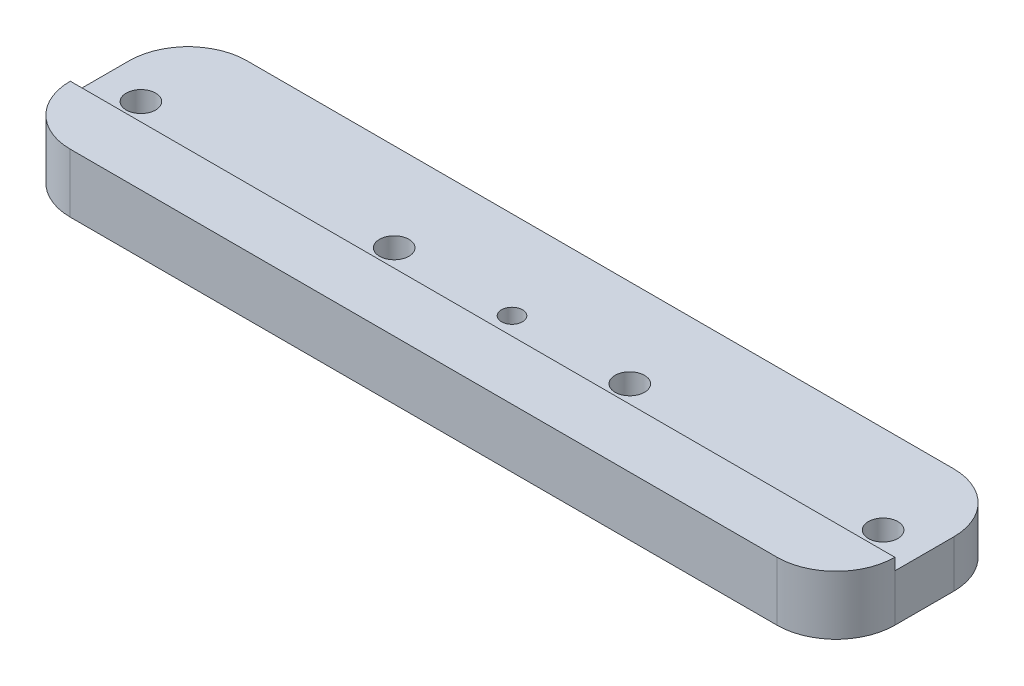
ISO-10303-21;
HEADER;
FILE_DESCRIPTION(('STEP AP214'),'2;1');
FILE_NAME('part.step','',(''),(''),'','','');
FILE_SCHEMA(('AUTOMOTIVE_DESIGN { 1 0 10303 214 1 1 1 1 }'));
ENDSEC;
DATA;
#1=APPLICATION_CONTEXT('core data for automotive mechanical design processes');
#2=APPLICATION_PROTOCOL_DEFINITION('international standard','automotive_design',2000,#1);
#3=PRODUCT_CONTEXT('',#1,'mechanical');
#4=PRODUCT('Part','Part','',(#3));
#5=PRODUCT_RELATED_PRODUCT_CATEGORY('part','',(#4));
#6=PRODUCT_DEFINITION_FORMATION('','',#4);
#7=PRODUCT_DEFINITION_CONTEXT('part definition',#1,'design');
#8=PRODUCT_DEFINITION('design','',#6,#7);
#9=PRODUCT_DEFINITION_SHAPE('','',#8);
#10=(LENGTH_UNIT() NAMED_UNIT(*) SI_UNIT(.MILLI.,.METRE.));
#11=(NAMED_UNIT(*) PLANE_ANGLE_UNIT() SI_UNIT($,.RADIAN.));
#12=(NAMED_UNIT(*) SI_UNIT($,.STERADIAN.) SOLID_ANGLE_UNIT());
#13=UNCERTAINTY_MEASURE_WITH_UNIT(LENGTH_MEASURE(1.E-05),#10,'distance_accuracy_value','');
#14=(GEOMETRIC_REPRESENTATION_CONTEXT(3) GLOBAL_UNCERTAINTY_ASSIGNED_CONTEXT((#13)) GLOBAL_UNIT_ASSIGNED_CONTEXT((#10,
#11,#12)) REPRESENTATION_CONTEXT('',''));
#15=CARTESIAN_POINT('',(0.,0.,0.));
#16=DIRECTION('',(0.,0.,1.));
#17=DIRECTION('',(1.,0.,0.));
#18=AXIS2_PLACEMENT_3D('',#15,#16,#17);
#19=CARTESIAN_POINT('',(44.45,6.35,9.525));
#20=DIRECTION('',(-1.,0.,0.));
#21=DIRECTION('',(0.,0.,1.));
#22=AXIS2_PLACEMENT_3D('',#19,#20,#21);
#23=PLANE('',#22);
#24=DIRECTION('',(0.,0.,-1.));
#25=VECTOR('',#24,1.);
#26=CARTESIAN_POINT('',(44.45,5.08,3.175));
#27=LINE('',#26,#25);
#28=CARTESIAN_POINT('',(44.45,5.08,3.175));
#29=VERTEX_POINT('',#28);
#30=CARTESIAN_POINT('',(44.45,5.08,-3.175));
#31=VERTEX_POINT('',#30);
#32=EDGE_CURVE('E125',#29,#31,#27,.T.);
#33=ORIENTED_EDGE('',*,*,#32,.F.);
#34=DIRECTION('',(0.,-1.,0.));
#35=VECTOR('',#34,1.);
#36=CARTESIAN_POINT('',(44.45,6.35,3.175));
#37=LINE('',#36,#35);
#38=CARTESIAN_POINT('',(44.45,0.,3.175));
#39=VERTEX_POINT('',#38);
#40=EDGE_CURVE('E120',#29,#39,#37,.T.);
#41=ORIENTED_EDGE('',*,*,#40,.T.);
#42=DIRECTION('',(0.,0.,-1.));
#43=VECTOR('',#42,1.);
#44=CARTESIAN_POINT('',(44.45,0.,9.525));
#45=LINE('',#44,#43);
#46=CARTESIAN_POINT('',(44.45,0.,-3.175));
#47=VERTEX_POINT('',#46);
#48=EDGE_CURVE('E189',#39,#47,#45,.T.);
#49=ORIENTED_EDGE('',*,*,#48,.T.);
#50=DIRECTION('',(0.,-1.,0.));
#51=VECTOR('',#50,1.);
#52=CARTESIAN_POINT('',(44.45,6.35,-3.175));
#53=LINE('',#52,#51);
#54=EDGE_CURVE('E119',#47,#31,#53,.F.);
#55=ORIENTED_EDGE('',*,*,#54,.T.);
#56=EDGE_LOOP('',(#33,#41,#49,#55));
#57=FACE_BOUND('',#56,.T.);
#58=ADVANCED_FACE('F37',(#57),#23,.F.);
#59=CARTESIAN_POINT('',(-44.45,6.35,-9.525));
#60=DIRECTION('',(0.,0.,1.));
#61=DIRECTION('',(1.,0.,0.));
#62=AXIS2_PLACEMENT_3D('',#59,#60,#61);
#63=PLANE('',#62);
#64=DIRECTION('',(-1.,0.,0.));
#65=VECTOR('',#64,1.);
#66=CARTESIAN_POINT('',(38.1,5.08,-9.525));
#67=LINE('',#66,#65);
#68=CARTESIAN_POINT('',(38.1,5.08,-9.525));
#69=VERTEX_POINT('',#68);
#70=CARTESIAN_POINT('',(-38.1,5.08,-9.525));
#71=VERTEX_POINT('',#70);
#72=EDGE_CURVE('E169',#69,#71,#67,.T.);
#73=ORIENTED_EDGE('',*,*,#72,.F.);
#74=DIRECTION('',(0.,-1.,0.));
#75=VECTOR('',#74,1.);
#76=CARTESIAN_POINT('',(38.1,6.35,-9.525));
#77=LINE('',#76,#75);
#78=CARTESIAN_POINT('',(38.1,0.,-9.525));
#79=VERTEX_POINT('',#78);
#80=EDGE_CURVE('E206',#69,#79,#77,.T.);
#81=ORIENTED_EDGE('',*,*,#80,.T.);
#82=DIRECTION('',(-1.,0.,0.));
#83=VECTOR('',#82,1.);
#84=CARTESIAN_POINT('',(-44.45,0.,-9.525));
#85=LINE('',#84,#83);
#86=CARTESIAN_POINT('',(-38.1,0.,-9.525));
#87=VERTEX_POINT('',#86);
#88=EDGE_CURVE('E195',#79,#87,#85,.T.);
#89=ORIENTED_EDGE('',*,*,#88,.T.);
#90=DIRECTION('',(0.,-1.,0.));
#91=VECTOR('',#90,1.);
#92=CARTESIAN_POINT('',(-38.1,6.35,-9.525));
#93=LINE('',#92,#91);
#94=EDGE_CURVE('E192',#87,#71,#93,.F.);
#95=ORIENTED_EDGE('',*,*,#94,.T.);
#96=EDGE_LOOP('',(#73,#81,#89,#95));
#97=FACE_BOUND('',#96,.T.);
#98=ADVANCED_FACE('F236',(#97),#63,.F.);
#99=CARTESIAN_POINT('',(-44.45,6.35,9.525));
#100=DIRECTION('',(1.,0.,0.));
#101=DIRECTION('',(0.,0.,-1.));
#102=AXIS2_PLACEMENT_3D('',#99,#100,#101);
#103=PLANE('',#102);
#104=DIRECTION('',(0.,0.,1.));
#105=VECTOR('',#104,1.);
#106=CARTESIAN_POINT('',(-44.45,5.08,-3.175));
#107=LINE('',#106,#105);
#108=CARTESIAN_POINT('',(-44.45,5.08,-3.175));
#109=VERTEX_POINT('',#108);
#110=CARTESIAN_POINT('',(-44.45,5.08,3.175));
#111=VERTEX_POINT('',#110);
#112=EDGE_CURVE('E52',#109,#111,#107,.T.);
#113=ORIENTED_EDGE('',*,*,#112,.F.);
#114=DIRECTION('',(0.,-1.,0.));
#115=VECTOR('',#114,1.);
#116=CARTESIAN_POINT('',(-44.45,6.35,-3.175));
#117=LINE('',#116,#115);
#118=CARTESIAN_POINT('',(-44.45,0.,-3.175));
#119=VERTEX_POINT('',#118);
#120=EDGE_CURVE('E11',#109,#119,#117,.T.);
#121=ORIENTED_EDGE('',*,*,#120,.T.);
#122=DIRECTION('',(0.,0.,1.));
#123=VECTOR('',#122,1.);
#124=CARTESIAN_POINT('',(-44.45,0.,9.525));
#125=LINE('',#124,#123);
#126=CARTESIAN_POINT('',(-44.45,0.,3.175));
#127=VERTEX_POINT('',#126);
#128=EDGE_CURVE('E157',#119,#127,#125,.T.);
#129=ORIENTED_EDGE('',*,*,#128,.T.);
#130=DIRECTION('',(0.,-1.,0.));
#131=VECTOR('',#130,1.);
#132=CARTESIAN_POINT('',(-44.45,6.35,3.175));
#133=LINE('',#132,#131);
#134=EDGE_CURVE('E45',#127,#111,#133,.F.);
#135=ORIENTED_EDGE('',*,*,#134,.T.);
#136=EDGE_LOOP('',(#113,#121,#129,#135));
#137=FACE_BOUND('',#136,.T.);
#138=ADVANCED_FACE('F154',(#137),#103,.F.);
#139=CARTESIAN_POINT('',(12.7,6.35,0.));
#140=DIRECTION('',(0.,1.,0.));
#141=DIRECTION('',(0.,0.,1.));
#142=AXIS2_PLACEMENT_3D('',#139,#140,#141);
#143=CYLINDRICAL_SURFACE('',#142,1.5875);
#144=CARTESIAN_POINT('',(12.7,0.,0.));
#145=DIRECTION('',(0.,-1.,0.));
#146=DIRECTION('',(0.,0.,-1.));
#147=AXIS2_PLACEMENT_3D('',#144,#145,#146);
#148=CIRCLE('',#147,1.5875);
#149=CARTESIAN_POINT('',(12.7,0.,-1.5875));
#150=VERTEX_POINT('',#149);
#151=EDGE_CURVE('E186',#150,#150,#148,.T.);
#152=ORIENTED_EDGE('',*,*,#151,.T.);
#153=EDGE_LOOP('',(#152));
#154=FACE_BOUND('',#153,.T.);
#155=CARTESIAN_POINT('',(12.7,5.08,0.));
#156=DIRECTION('',(0.,1.,0.));
#157=DIRECTION('',(0.,0.,1.));
#158=AXIS2_PLACEMENT_3D('',#155,#156,#157);
#159=CIRCLE('',#158,1.5875);
#160=CARTESIAN_POINT('',(12.7,5.08,1.5875));
#161=VERTEX_POINT('',#160);
#162=EDGE_CURVE('E178',#161,#161,#159,.F.);
#163=ORIENTED_EDGE('',*,*,#162,.F.);
#164=EDGE_LOOP('',(#163));
#165=FACE_BOUND('',#164,.T.);
#166=ADVANCED_FACE('F260',(#154,#165),#143,.F.);
#167=CARTESIAN_POINT('',(-12.7,6.35,0.));
#168=DIRECTION('',(0.,1.,0.));
#169=DIRECTION('',(0.,0.,1.));
#170=AXIS2_PLACEMENT_3D('',#167,#168,#169);
#171=CYLINDRICAL_SURFACE('',#170,1.5875);
#172=CARTESIAN_POINT('',(-12.7,0.,0.));
#173=DIRECTION('',(0.,-1.,0.));
#174=DIRECTION('',(0.,0.,-1.));
#175=AXIS2_PLACEMENT_3D('',#172,#173,#174);
#176=CIRCLE('',#175,1.5875);
#177=CARTESIAN_POINT('',(-12.7,0.,-1.5875));
#178=VERTEX_POINT('',#177);
#179=EDGE_CURVE('E185',#178,#178,#176,.T.);
#180=ORIENTED_EDGE('',*,*,#179,.T.);
#181=EDGE_LOOP('',(#180));
#182=FACE_BOUND('',#181,.T.);
#183=CARTESIAN_POINT('',(-12.7,5.08,0.));
#184=DIRECTION('',(0.,1.,0.));
#185=DIRECTION('',(0.,0.,1.));
#186=AXIS2_PLACEMENT_3D('',#183,#184,#185);
#187=CIRCLE('',#186,1.5875);
#188=CARTESIAN_POINT('',(-12.7,5.08,1.5875));
#189=VERTEX_POINT('',#188);
#190=EDGE_CURVE('E175',#189,#189,#187,.F.);
#191=ORIENTED_EDGE('',*,*,#190,.F.);
#192=EDGE_LOOP('',(#191));
#193=FACE_BOUND('',#192,.T.);
#194=ADVANCED_FACE('F270',(#182,#193),#171,.F.);
#195=CARTESIAN_POINT('',(40.005,6.35,0.));
#196=DIRECTION('',(0.,1.,0.));
#197=DIRECTION('',(0.,0.,1.));
#198=AXIS2_PLACEMENT_3D('',#195,#196,#197);
#199=CYLINDRICAL_SURFACE('',#198,1.5875);
#200=CARTESIAN_POINT('',(40.005,0.,0.));
#201=DIRECTION('',(0.,-1.,0.));
#202=DIRECTION('',(0.,0.,-1.));
#203=AXIS2_PLACEMENT_3D('',#200,#201,#202);
#204=CIRCLE('',#203,1.5875);
#205=CARTESIAN_POINT('',(40.005,0.,-1.5875));
#206=VERTEX_POINT('',#205);
#207=EDGE_CURVE('E182',#206,#206,#204,.T.);
#208=ORIENTED_EDGE('',*,*,#207,.T.);
#209=EDGE_LOOP('',(#208));
#210=FACE_BOUND('',#209,.T.);
#211=CARTESIAN_POINT('',(40.005,5.08,0.));
#212=DIRECTION('',(0.,1.,0.));
#213=DIRECTION('',(0.,0.,1.));
#214=AXIS2_PLACEMENT_3D('',#211,#212,#213);
#215=CIRCLE('',#214,1.5875);
#216=CARTESIAN_POINT('',(40.005,5.08,1.5875));
#217=VERTEX_POINT('',#216);
#218=EDGE_CURVE('E167',#217,#217,#215,.F.);
#219=ORIENTED_EDGE('',*,*,#218,.F.);
#220=EDGE_LOOP('',(#219));
#221=FACE_BOUND('',#220,.T.);
#222=ADVANCED_FACE('F247',(#210,#221),#199,.F.);
#223=CARTESIAN_POINT('',(-40.005,6.35,0.));
#224=DIRECTION('',(0.,1.,0.));
#225=DIRECTION('',(0.,0.,1.));
#226=AXIS2_PLACEMENT_3D('',#223,#224,#225);
#227=CYLINDRICAL_SURFACE('',#226,1.5875);
#228=CARTESIAN_POINT('',(-40.005,0.,0.));
#229=DIRECTION('',(0.,-1.,0.));
#230=DIRECTION('',(0.,0.,-1.));
#231=AXIS2_PLACEMENT_3D('',#228,#229,#230);
#232=CIRCLE('',#231,1.5875);
#233=CARTESIAN_POINT('',(-40.005,0.,-1.5875));
#234=VERTEX_POINT('',#233);
#235=EDGE_CURVE('E181',#234,#234,#232,.T.);
#236=ORIENTED_EDGE('',*,*,#235,.T.);
#237=EDGE_LOOP('',(#236));
#238=FACE_BOUND('',#237,.T.);
#239=CARTESIAN_POINT('',(-40.005,5.08,0.));
#240=DIRECTION('',(0.,1.,0.));
#241=DIRECTION('',(0.,0.,1.));
#242=AXIS2_PLACEMENT_3D('',#239,#240,#241);
#243=CIRCLE('',#242,1.5875);
#244=CARTESIAN_POINT('',(-40.005,5.08,1.5875));
#245=VERTEX_POINT('',#244);
#246=EDGE_CURVE('E163',#245,#245,#243,.F.);
#247=ORIENTED_EDGE('',*,*,#246,.F.);
#248=EDGE_LOOP('',(#247));
#249=FACE_BOUND('',#248,.T.);
#250=ADVANCED_FACE('F241',(#238,#249),#227,.F.);
#251=CARTESIAN_POINT('',(38.1,6.35,-3.175));
#252=DIRECTION('',(0.,-1.,0.));
#253=DIRECTION('',(0.,0.,-1.));
#254=AXIS2_PLACEMENT_3D('',#251,#252,#253);
#255=CYLINDRICAL_SURFACE('',#254,6.35);
#256=ORIENTED_EDGE('',*,*,#80,.F.);
#257=CARTESIAN_POINT('',(38.1,5.08,-3.175));
#258=DIRECTION('',(0.,1.,0.));
#259=DIRECTION('',(0.,0.,1.));
#260=AXIS2_PLACEMENT_3D('',#257,#258,#259);
#261=CIRCLE('',#260,6.35);
#262=EDGE_CURVE('E133',#31,#69,#261,.T.);
#263=ORIENTED_EDGE('',*,*,#262,.F.);
#264=ORIENTED_EDGE('',*,*,#54,.F.);
#265=CARTESIAN_POINT('',(38.1,0.,-3.175));
#266=DIRECTION('',(0.,-1.,0.));
#267=DIRECTION('',(0.,0.,-1.));
#268=AXIS2_PLACEMENT_3D('',#265,#266,#267);
#269=CIRCLE('',#268,6.35);
#270=EDGE_CURVE('E138',#79,#47,#269,.T.);
#271=ORIENTED_EDGE('',*,*,#270,.F.);
#272=EDGE_LOOP('',(#256,#263,#264,#271));
#273=FACE_BOUND('',#272,.T.);
#274=ADVANCED_FACE('F239',(#273),#255,.T.);
#275=CARTESIAN_POINT('',(-38.1,6.35,-3.175));
#276=DIRECTION('',(0.,-1.,0.));
#277=DIRECTION('',(0.,0.,-1.));
#278=AXIS2_PLACEMENT_3D('',#275,#276,#277);
#279=CYLINDRICAL_SURFACE('',#278,6.35);
#280=ORIENTED_EDGE('',*,*,#120,.F.);
#281=CARTESIAN_POINT('',(-38.1,5.08,-3.175));
#282=DIRECTION('',(0.,1.,0.));
#283=DIRECTION('',(0.,0.,1.));
#284=AXIS2_PLACEMENT_3D('',#281,#282,#283);
#285=CIRCLE('',#284,6.35);
#286=EDGE_CURVE('E164',#71,#109,#285,.T.);
#287=ORIENTED_EDGE('',*,*,#286,.F.);
#288=ORIENTED_EDGE('',*,*,#94,.F.);
#289=CARTESIAN_POINT('',(-38.1,0.,-3.175));
#290=DIRECTION('',(0.,-1.,0.));
#291=DIRECTION('',(0.,0.,-1.));
#292=AXIS2_PLACEMENT_3D('',#289,#290,#291);
#293=CIRCLE('',#292,6.35);
#294=EDGE_CURVE('E209',#119,#87,#293,.T.);
#295=ORIENTED_EDGE('',*,*,#294,.F.);
#296=EDGE_LOOP('',(#280,#287,#288,#295));
#297=FACE_BOUND('',#296,.T.);
#298=ADVANCED_FACE('F234',(#297),#279,.T.);
#299=CARTESIAN_POINT('',(-44.45,6.35,9.525));
#300=DIRECTION('',(0.,0.,-1.));
#301=DIRECTION('',(-1.,0.,0.));
#302=AXIS2_PLACEMENT_3D('',#299,#300,#301);
#303=PLANE('',#302);
#304=DIRECTION('',(1.,0.,0.));
#305=VECTOR('',#304,1.);
#306=CARTESIAN_POINT('',(-44.45,0.,9.525));
#307=LINE('',#306,#305);
#308=CARTESIAN_POINT('',(-38.1,0.,9.525));
#309=VERTEX_POINT('',#308);
#310=CARTESIAN_POINT('',(38.1,0.,9.525));
#311=VERTEX_POINT('',#310);
#312=EDGE_CURVE('E193',#309,#311,#307,.T.);
#313=ORIENTED_EDGE('',*,*,#312,.T.);
#314=DIRECTION('',(0.,-1.,0.));
#315=VECTOR('',#314,1.);
#316=CARTESIAN_POINT('',(38.1,6.35,9.525));
#317=LINE('',#316,#315);
#318=CARTESIAN_POINT('',(38.1,6.35,9.525));
#319=VERTEX_POINT('',#318);
#320=EDGE_CURVE('E60',#311,#319,#317,.F.);
#321=ORIENTED_EDGE('',*,*,#320,.T.);
#322=DIRECTION('',(1.,0.,0.));
#323=VECTOR('',#322,1.);
#324=CARTESIAN_POINT('',(-44.45,6.35,9.525));
#325=LINE('',#324,#323);
#326=CARTESIAN_POINT('',(-38.1,6.35,9.525));
#327=VERTEX_POINT('',#326);
#328=EDGE_CURVE('E190',#327,#319,#325,.T.);
#329=ORIENTED_EDGE('',*,*,#328,.F.);
#330=DIRECTION('',(0.,-1.,0.));
#331=VECTOR('',#330,1.);
#332=CARTESIAN_POINT('',(-38.1,6.35,9.525));
#333=LINE('',#332,#331);
#334=EDGE_CURVE('E147',#327,#309,#333,.T.);
#335=ORIENTED_EDGE('',*,*,#334,.T.);
#336=EDGE_LOOP('',(#313,#321,#329,#335));
#337=FACE_BOUND('',#336,.T.);
#338=ADVANCED_FACE('F214',(#337),#303,.F.);
#339=CARTESIAN_POINT('',(44.45,6.35,-9.525));
#340=DIRECTION('',(0.,-1.,0.));
#341=DIRECTION('',(0.,0.,-1.));
#342=AXIS2_PLACEMENT_3D('',#339,#340,#341);
#343=PLANE('',#342);
#344=CARTESIAN_POINT('',(38.1,6.35,3.175));
#345=DIRECTION('',(0.,-1.,0.));
#346=DIRECTION('',(0.,0.,-1.));
#347=AXIS2_PLACEMENT_3D('',#344,#345,#346);
#348=CIRCLE('',#347,6.35);
#349=CARTESIAN_POINT('',(44.45,6.35,3.175));
#350=VERTEX_POINT('',#349);
#351=EDGE_CURVE('E145',#319,#350,#348,.F.);
#352=ORIENTED_EDGE('',*,*,#351,.T.);
#353=DIRECTION('',(1.,0.,0.));
#354=VECTOR('',#353,1.);
#355=CARTESIAN_POINT('',(-44.45,6.35,3.175));
#356=LINE('',#355,#354);
#357=CARTESIAN_POINT('',(-44.45,6.35,3.175));
#358=VERTEX_POINT('',#357);
#359=EDGE_CURVE('E114',#358,#350,#356,.T.);
#360=ORIENTED_EDGE('',*,*,#359,.F.);
#361=CARTESIAN_POINT('',(-38.1,6.35,3.175));
#362=DIRECTION('',(0.,-1.,0.));
#363=DIRECTION('',(0.,0.,-1.));
#364=AXIS2_PLACEMENT_3D('',#361,#362,#363);
#365=CIRCLE('',#364,6.35);
#366=EDGE_CURVE('E143',#358,#327,#365,.F.);
#367=ORIENTED_EDGE('',*,*,#366,.T.);
#368=ORIENTED_EDGE('',*,*,#328,.T.);
#369=EDGE_LOOP('',(#352,#360,#367,#368));
#370=FACE_BOUND('',#369,.T.);
#371=ADVANCED_FACE('F216',(#370),#343,.F.);
#372=CARTESIAN_POINT('',(44.45,0.,-9.525));
#373=DIRECTION('',(0.,-1.,0.));
#374=DIRECTION('',(0.,0.,-1.));
#375=AXIS2_PLACEMENT_3D('',#372,#373,#374);
#376=PLANE('',#375);
#377=CARTESIAN_POINT('',(0.,0.,0.));
#378=DIRECTION('',(0.,-1.,0.));
#379=DIRECTION('',(0.,0.,-1.));
#380=AXIS2_PLACEMENT_3D('',#377,#378,#379);
#381=CIRCLE('',#380,1.13029999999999);
#382=CARTESIAN_POINT('',(0.,0.,-1.13029999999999));
#383=VERTEX_POINT('',#382);
#384=EDGE_CURVE('E217',#383,#383,#381,.T.);
#385=ORIENTED_EDGE('',*,*,#384,.F.);
#386=EDGE_LOOP('',(#385));
#387=FACE_BOUND('',#386,.T.);
#388=ORIENTED_EDGE('',*,*,#235,.F.);
#389=EDGE_LOOP('',(#388));
#390=FACE_BOUND('',#389,.T.);
#391=ORIENTED_EDGE('',*,*,#207,.F.);
#392=EDGE_LOOP('',(#391));
#393=FACE_BOUND('',#392,.T.);
#394=ORIENTED_EDGE('',*,*,#179,.F.);
#395=EDGE_LOOP('',(#394));
#396=FACE_BOUND('',#395,.T.);
#397=ORIENTED_EDGE('',*,*,#151,.F.);
#398=EDGE_LOOP('',(#397));
#399=FACE_BOUND('',#398,.T.);
#400=ORIENTED_EDGE('',*,*,#88,.F.);
#401=ORIENTED_EDGE('',*,*,#270,.T.);
#402=ORIENTED_EDGE('',*,*,#48,.F.);
#403=CARTESIAN_POINT('',(38.1,0.,3.175));
#404=DIRECTION('',(0.,-1.,0.));
#405=DIRECTION('',(0.,0.,-1.));
#406=AXIS2_PLACEMENT_3D('',#403,#404,#405);
#407=CIRCLE('',#406,6.35);
#408=EDGE_CURVE('E136',#39,#311,#407,.T.);
#409=ORIENTED_EDGE('',*,*,#408,.T.);
#410=ORIENTED_EDGE('',*,*,#312,.F.);
#411=CARTESIAN_POINT('',(-38.1,0.,3.175));
#412=DIRECTION('',(0.,-1.,0.));
#413=DIRECTION('',(0.,0.,-1.));
#414=AXIS2_PLACEMENT_3D('',#411,#412,#413);
#415=CIRCLE('',#414,6.35);
#416=EDGE_CURVE('E161',#309,#127,#415,.T.);
#417=ORIENTED_EDGE('',*,*,#416,.T.);
#418=ORIENTED_EDGE('',*,*,#128,.F.);
#419=ORIENTED_EDGE('',*,*,#294,.T.);
#420=EDGE_LOOP('',(#400,#401,#402,#409,#410,#417,#418,#419));
#421=FACE_BOUND('',#420,.T.);
#422=ADVANCED_FACE('F213',(#387,#390,#393,#396,#399,#421),#376,.T.);
#423=CARTESIAN_POINT('',(38.1,6.35,3.175));
#424=DIRECTION('',(0.,-1.,0.));
#425=DIRECTION('',(0.,0.,-1.));
#426=AXIS2_PLACEMENT_3D('',#423,#424,#425);
#427=CYLINDRICAL_SURFACE('',#426,6.35);
#428=ORIENTED_EDGE('',*,*,#351,.F.);
#429=ORIENTED_EDGE('',*,*,#320,.F.);
#430=ORIENTED_EDGE('',*,*,#408,.F.);
#431=ORIENTED_EDGE('',*,*,#40,.F.);
#432=EDGE_CURVE('E109',#350,#29,#37,.T.);
#433=ORIENTED_EDGE('',*,*,#432,.F.);
#434=EDGE_LOOP('',(#428,#429,#430,#431,#433));
#435=FACE_BOUND('',#434,.T.);
#436=ADVANCED_FACE('F135',(#435),#427,.T.);
#437=CARTESIAN_POINT('',(-38.1,6.35,3.175));
#438=DIRECTION('',(0.,-1.,0.));
#439=DIRECTION('',(0.,0.,-1.));
#440=AXIS2_PLACEMENT_3D('',#437,#438,#439);
#441=CYLINDRICAL_SURFACE('',#440,6.35);
#442=ORIENTED_EDGE('',*,*,#366,.F.);
#443=DIRECTION('',(0.,1.,0.));
#444=VECTOR('',#443,1.);
#445=CARTESIAN_POINT('',(-44.45,5.08,3.175));
#446=LINE('',#445,#444);
#447=EDGE_CURVE('E162',#111,#358,#446,.T.);
#448=ORIENTED_EDGE('',*,*,#447,.F.);
#449=ORIENTED_EDGE('',*,*,#134,.F.);
#450=ORIENTED_EDGE('',*,*,#416,.F.);
#451=ORIENTED_EDGE('',*,*,#334,.F.);
#452=EDGE_LOOP('',(#442,#448,#449,#450,#451));
#453=FACE_BOUND('',#452,.T.);
#454=ADVANCED_FACE('F39',(#453),#441,.T.);
#455=CARTESIAN_POINT('',(38.1,5.08,-3.175));
#456=DIRECTION('',(0.,1.,0.));
#457=DIRECTION('',(0.,0.,1.));
#458=AXIS2_PLACEMENT_3D('',#455,#456,#457);
#459=PLANE('',#458);
#460=CARTESIAN_POINT('',(0.,5.08,0.));
#461=DIRECTION('',(0.,1.,0.));
#462=DIRECTION('',(0.,0.,1.));
#463=AXIS2_PLACEMENT_3D('',#460,#461,#462);
#464=CIRCLE('',#463,1.13029999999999);
#465=CARTESIAN_POINT('',(0.,5.08,1.13029999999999));
#466=VERTEX_POINT('',#465);
#467=EDGE_CURVE('E220',#466,#466,#464,.T.);
#468=ORIENTED_EDGE('',*,*,#467,.F.);
#469=EDGE_LOOP('',(#468));
#470=FACE_BOUND('',#469,.T.);
#471=ORIENTED_EDGE('',*,*,#190,.T.);
#472=EDGE_LOOP('',(#471));
#473=FACE_BOUND('',#472,.T.);
#474=ORIENTED_EDGE('',*,*,#246,.T.);
#475=EDGE_LOOP('',(#474));
#476=FACE_BOUND('',#475,.T.);
#477=ORIENTED_EDGE('',*,*,#112,.T.);
#478=DIRECTION('',(1.,0.,0.));
#479=VECTOR('',#478,1.);
#480=CARTESIAN_POINT('',(-44.45,5.08,3.175));
#481=LINE('',#480,#479);
#482=EDGE_CURVE('E111',#111,#29,#481,.T.);
#483=ORIENTED_EDGE('',*,*,#482,.T.);
#484=ORIENTED_EDGE('',*,*,#32,.T.);
#485=ORIENTED_EDGE('',*,*,#262,.T.);
#486=ORIENTED_EDGE('',*,*,#72,.T.);
#487=ORIENTED_EDGE('',*,*,#286,.T.);
#488=EDGE_LOOP('',(#477,#483,#484,#485,#486,#487));
#489=FACE_BOUND('',#488,.T.);
#490=ORIENTED_EDGE('',*,*,#218,.T.);
#491=EDGE_LOOP('',(#490));
#492=FACE_BOUND('',#491,.T.);
#493=ORIENTED_EDGE('',*,*,#162,.T.);
#494=EDGE_LOOP('',(#493));
#495=FACE_BOUND('',#494,.T.);
#496=ADVANCED_FACE('F123',(#470,#473,#476,#489,#492,#495),#459,.T.);
#497=CARTESIAN_POINT('',(-44.45,5.08,3.175));
#498=DIRECTION('',(0.,0.,1.));
#499=DIRECTION('',(1.,0.,0.));
#500=AXIS2_PLACEMENT_3D('',#497,#498,#499);
#501=PLANE('',#500);
#502=ORIENTED_EDGE('',*,*,#359,.T.);
#503=ORIENTED_EDGE('',*,*,#432,.T.);
#504=ORIENTED_EDGE('',*,*,#482,.F.);
#505=ORIENTED_EDGE('',*,*,#447,.T.);
#506=EDGE_LOOP('',(#502,#503,#504,#505));
#507=FACE_BOUND('',#506,.T.);
#508=ADVANCED_FACE('F110',(#507),#501,.F.);
#509=CARTESIAN_POINT('',(0.,5.08,0.));
#510=DIRECTION('',(0.,1.,0.));
#511=DIRECTION('',(0.,0.,1.));
#512=AXIS2_PLACEMENT_3D('',#509,#510,#511);
#513=CYLINDRICAL_SURFACE('',#512,1.13029999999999);
#514=ORIENTED_EDGE('',*,*,#384,.T.);
#515=EDGE_LOOP('',(#514));
#516=FACE_BOUND('',#515,.T.);
#517=ORIENTED_EDGE('',*,*,#467,.T.);
#518=EDGE_LOOP('',(#517));
#519=FACE_BOUND('',#518,.T.);
#520=ADVANCED_FACE('F280',(#516,#519),#513,.F.);
#521=CLOSED_SHELL('',(#58,#98,#138,#166,#194,#222,#250,#274,#298,#338,#371,#422,#436,#454,#496,
#508,#520));
#522=MANIFOLD_SOLID_BREP('B2',#521);
#523=ADVANCED_BREP_SHAPE_REPRESENTATION('',(#18,#522),#14);
#524=SHAPE_DEFINITION_REPRESENTATION(#9,#523);
ENDSEC;
END-ISO-10303-21;
